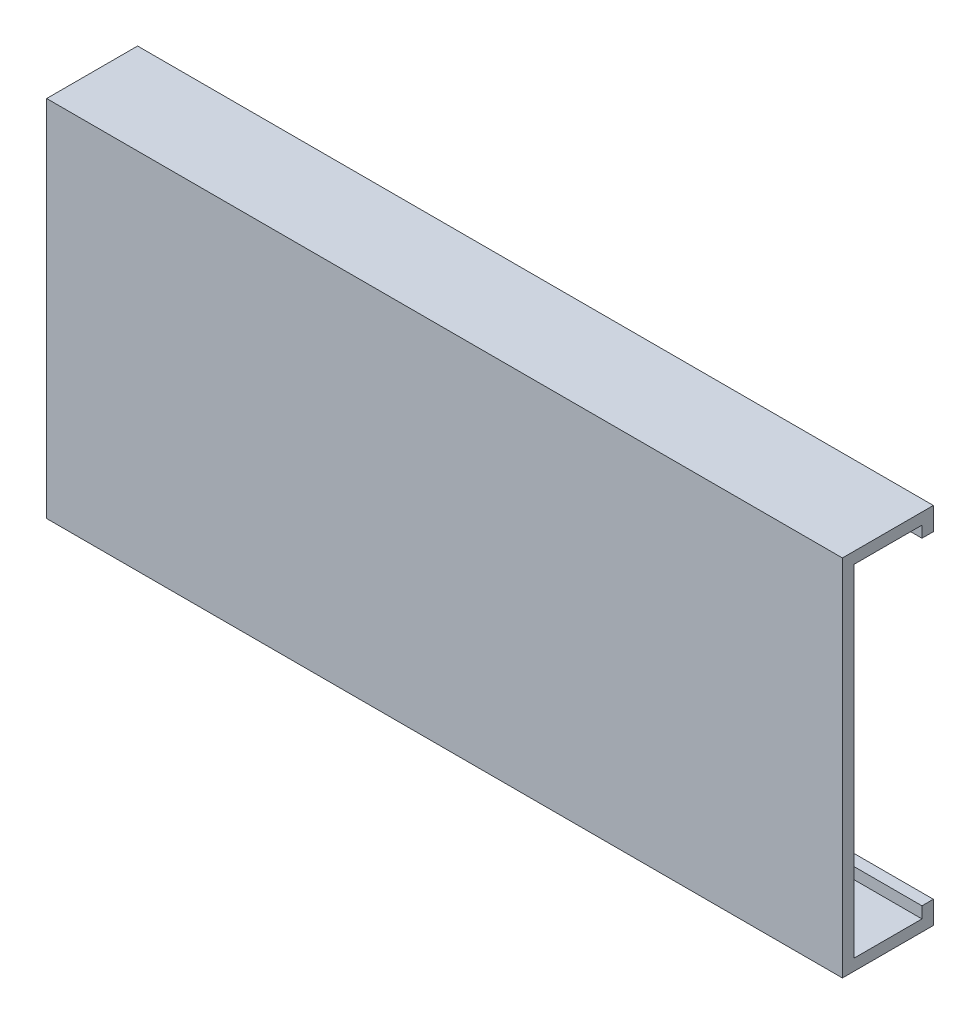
from build123d import *

# Parameters (mm, degrees)
SKETCH1_W                = 70
SKETCH1_H                = 30
BOSS_EXTRUDE1_DEPTH      = 1
SKETCH2_W                = 70
SKETCH2_H                = 8
BOSS_EXTRUDE2_DEPTH      = 1
BOSS_EXTRUDE3_DEPTH      = 7
BOSS_EXTRUDE3_DEPTH_BACK = 1
SKETCH3_W                = 70
SKETCH3_H                = 1
SKETCH4_W                = 1
SKETCH4_H                = 1
BOSS_EXTRUDE4_DEPTH      = 70


with BuildPart() as part:
    # Sketch1 → Boss-Extrude1 (new body)
    with BuildSketch(Plane.XY):
        Rectangle(SKETCH1_W, SKETCH1_H)
    extrude(amount=BOSS_EXTRUDE1_DEPTH)

    # Sketch2 → Boss-Extrude2 (add)
    with BuildSketch(Plane(origin=(0, 15, 0), x_dir=(1, 0, 0), z_dir=(0, 1, 0))):
        with Locations((0, 3)):
            Rectangle(SKETCH2_W, SKETCH2_H)
    extrude(amount=BOSS_EXTRUDE2_DEPTH)

    # Sketch3 → Boss-Extrude3 (add, two sides: drawn at the far end of the back side and taken through both)
    with BuildSketch(Plane(origin=(0, 0, 0), x_dir=(-1, 0, 0), z_dir=(0, 0, -1)).offset(-BOSS_EXTRUDE3_DEPTH_BACK)):
        with Locations((0, -15.5)):
            Rectangle(SKETCH3_W, SKETCH3_H)
    extrude(amount=BOSS_EXTRUDE3_DEPTH + BOSS_EXTRUDE3_DEPTH_BACK)

    # Sketch4 → Boss-Extrude4 (add)
    with BuildSketch(Plane(origin=(35, 0, 0), x_dir=(0, 0, -1), z_dir=(1, 0, 0))):
        with Locations((6.5, 14.5)):
            Rectangle(SKETCH4_W, SKETCH4_H)
        with Locations((6.5, -14.5)):
            Rectangle(SKETCH4_W, SKETCH4_H)
    extrude(amount=-BOSS_EXTRUDE4_DEPTH)


solid = part.part
